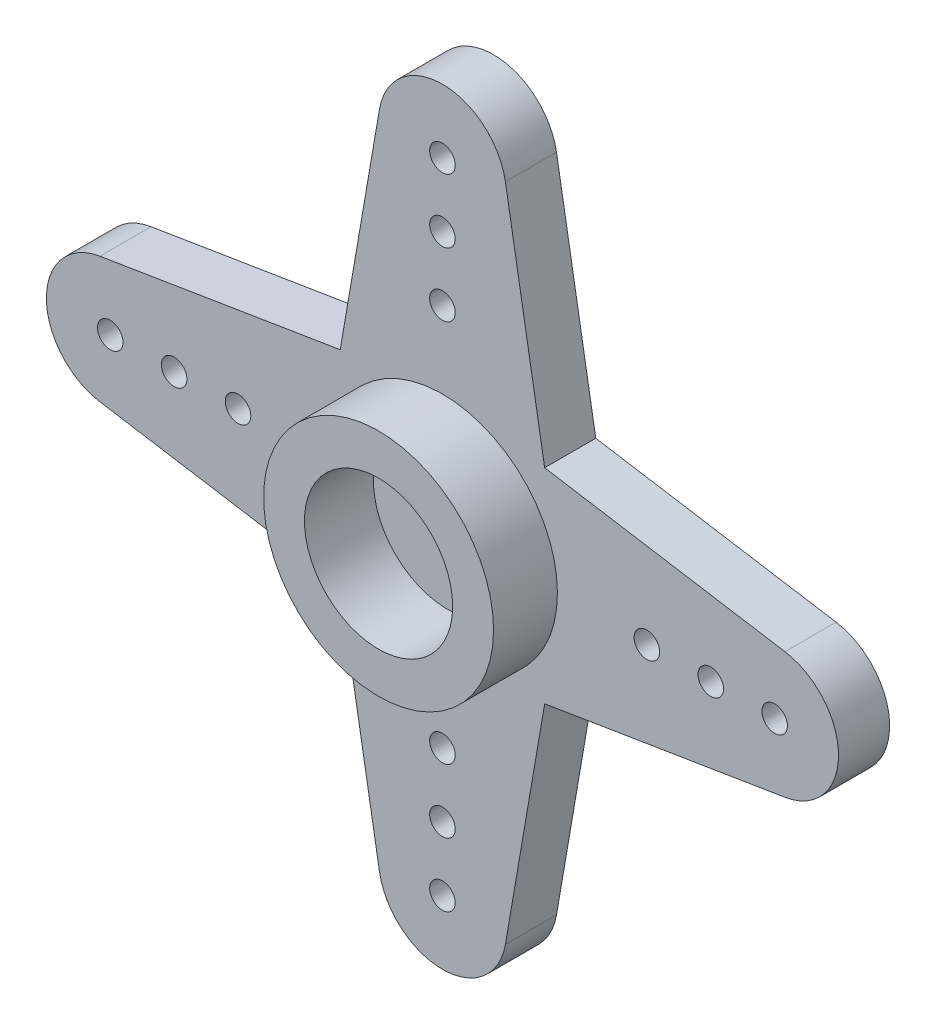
ISO-10303-21;
HEADER;
FILE_DESCRIPTION(('STEP AP214'),'2;1');
FILE_NAME('part.step','',(''),(''),'','','');
FILE_SCHEMA(('AUTOMOTIVE_DESIGN { 1 0 10303 214 1 1 1 1 }'));
ENDSEC;
DATA;
#1=APPLICATION_CONTEXT('core data for automotive mechanical design processes');
#2=APPLICATION_PROTOCOL_DEFINITION('international standard','automotive_design',2000,#1);
#3=PRODUCT_CONTEXT('',#1,'mechanical');
#4=PRODUCT('Part','Part','',(#3));
#5=PRODUCT_RELATED_PRODUCT_CATEGORY('part','',(#4));
#6=PRODUCT_DEFINITION_FORMATION('','',#4);
#7=PRODUCT_DEFINITION_CONTEXT('part definition',#1,'design');
#8=PRODUCT_DEFINITION('design','',#6,#7);
#9=PRODUCT_DEFINITION_SHAPE('','',#8);
#10=(LENGTH_UNIT() NAMED_UNIT(*) SI_UNIT(.MILLI.,.METRE.));
#11=(NAMED_UNIT(*) PLANE_ANGLE_UNIT() SI_UNIT($,.RADIAN.));
#12=(NAMED_UNIT(*) SI_UNIT($,.STERADIAN.) SOLID_ANGLE_UNIT());
#13=UNCERTAINTY_MEASURE_WITH_UNIT(LENGTH_MEASURE(1.E-05),#10,'distance_accuracy_value','');
#14=(GEOMETRIC_REPRESENTATION_CONTEXT(3) GLOBAL_UNCERTAINTY_ASSIGNED_CONTEXT((#13)) GLOBAL_UNIT_ASSIGNED_CONTEXT((#10,
#11,#12)) REPRESENTATION_CONTEXT('',''));
#15=CARTESIAN_POINT('',(0.,0.,0.));
#16=DIRECTION('',(0.,0.,1.));
#17=DIRECTION('',(1.,0.,0.));
#18=AXIS2_PLACEMENT_3D('',#15,#16,#17);
#19=CARTESIAN_POINT('',(0.,-12.5,2.));
#20=DIRECTION('',(0.,0.,1.));
#21=DIRECTION('',(1.,0.,0.));
#22=AXIS2_PLACEMENT_3D('',#19,#20,#21);
#23=PLANE('',#22);
#24=CARTESIAN_POINT('',(0.,-12.5,2.));
#25=DIRECTION('',(0.,0.,1.));
#26=DIRECTION('',(1.,0.,0.));
#27=AXIS2_PLACEMENT_3D('',#24,#25,#26);
#28=CIRCLE('',#27,0.5);
#29=CARTESIAN_POINT('',(0.5,-12.5,2.));
#30=VERTEX_POINT('',#29);
#31=EDGE_CURVE('E570',#30,#30,#28,.T.);
#32=ORIENTED_EDGE('',*,*,#31,.F.);
#33=EDGE_LOOP('',(#32));
#34=FACE_BOUND('',#33,.T.);
#35=CARTESIAN_POINT('',(0.,-7.5,2.));
#36=DIRECTION('',(0.,0.,1.));
#37=DIRECTION('',(1.,0.,0.));
#38=AXIS2_PLACEMENT_3D('',#35,#36,#37);
#39=CIRCLE('',#38,0.5);
#40=CARTESIAN_POINT('',(0.5,-7.5,2.));
#41=VERTEX_POINT('',#40);
#42=EDGE_CURVE('E582',#41,#41,#39,.T.);
#43=ORIENTED_EDGE('',*,*,#42,.F.);
#44=EDGE_LOOP('',(#43));
#45=FACE_BOUND('',#44,.T.);
#46=CARTESIAN_POINT('',(0.,10.,2.));
#47=DIRECTION('',(0.,0.,1.));
#48=DIRECTION('',(1.,0.,0.));
#49=AXIS2_PLACEMENT_3D('',#46,#47,#48);
#50=CIRCLE('',#49,0.5);
#51=CARTESIAN_POINT('',(0.5,10.,2.));
#52=VERTEX_POINT('',#51);
#53=EDGE_CURVE('E594',#52,#52,#50,.T.);
#54=ORIENTED_EDGE('',*,*,#53,.F.);
#55=EDGE_LOOP('',(#54));
#56=FACE_BOUND('',#55,.T.);
#57=CARTESIAN_POINT('',(10.5,0.,2.));
#58=DIRECTION('',(0.,0.,1.));
#59=DIRECTION('',(1.,0.,0.));
#60=AXIS2_PLACEMENT_3D('',#57,#58,#59);
#61=CIRCLE('',#60,0.500000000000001);
#62=CARTESIAN_POINT('',(11.,0.,2.));
#63=VERTEX_POINT('',#62);
#64=EDGE_CURVE('E606',#63,#63,#61,.T.);
#65=ORIENTED_EDGE('',*,*,#64,.F.);
#66=EDGE_LOOP('',(#65));
#67=FACE_BOUND('',#66,.T.);
#68=CARTESIAN_POINT('',(-8.,0.,2.));
#69=DIRECTION('',(0.,0.,1.));
#70=DIRECTION('',(1.,0.,0.));
#71=AXIS2_PLACEMENT_3D('',#68,#69,#70);
#72=CIRCLE('',#71,0.500000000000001);
#73=CARTESIAN_POINT('',(-7.5,0.,2.));
#74=VERTEX_POINT('',#73);
#75=EDGE_CURVE('E618',#74,#74,#72,.T.);
#76=ORIENTED_EDGE('',*,*,#75,.F.);
#77=EDGE_LOOP('',(#76));
#78=FACE_BOUND('',#77,.T.);
#79=CARTESIAN_POINT('',(-13.,0.,2.));
#80=DIRECTION('',(0.,0.,1.));
#81=DIRECTION('',(1.,0.,0.));
#82=AXIS2_PLACEMENT_3D('',#79,#80,#81);
#83=CIRCLE('',#82,0.500000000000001);
#84=CARTESIAN_POINT('',(-12.5,0.,2.));
#85=VERTEX_POINT('',#84);
#86=EDGE_CURVE('E630',#85,#85,#83,.T.);
#87=ORIENTED_EDGE('',*,*,#86,.F.);
#88=EDGE_LOOP('',(#87));
#89=FACE_BOUND('',#88,.T.);
#90=DIRECTION('',(0.169649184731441,0.985504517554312,0.));
#91=VECTOR('',#90,1.);
#92=CARTESIAN_POINT('',(4.,-4.,2.));
#93=LINE('',#92,#91);
#94=CARTESIAN_POINT('',(2.46376129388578,-12.9241229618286,2.));
#95=VERTEX_POINT('',#94);
#96=CARTESIAN_POINT('',(4.,-4.,2.));
#97=VERTEX_POINT('',#96);
#98=EDGE_CURVE('E179',#95,#97,#93,.T.);
#99=ORIENTED_EDGE('',*,*,#98,.T.);
#100=DIRECTION('',(0.986974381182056,0.160877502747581,0.));
#101=VECTOR('',#100,1.);
#102=CARTESIAN_POINT('',(13.402193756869,-2.46743595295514,2.));
#103=LINE('',#102,#101);
#104=CARTESIAN_POINT('',(13.402193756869,-2.46743595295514,2.));
#105=VERTEX_POINT('',#104);
#106=EDGE_CURVE('E107',#97,#105,#103,.T.);
#107=ORIENTED_EDGE('',*,*,#106,.T.);
#108=CARTESIAN_POINT('',(13.,0.,2.));
#109=DIRECTION('',(0.,0.,1.));
#110=DIRECTION('',(1.,0.,0.));
#111=AXIS2_PLACEMENT_3D('',#108,#109,#110);
#112=CIRCLE('',#111,2.5);
#113=CARTESIAN_POINT('',(13.402193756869,2.46743595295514,2.));
#114=VERTEX_POINT('',#113);
#115=EDGE_CURVE('E225',#105,#114,#112,.T.);
#116=ORIENTED_EDGE('',*,*,#115,.T.);
#117=DIRECTION('',(-0.986974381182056,0.16087750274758,0.));
#118=VECTOR('',#117,1.);
#119=CARTESIAN_POINT('',(4.,4.,2.));
#120=LINE('',#119,#118);
#121=CARTESIAN_POINT('',(4.,4.,2.));
#122=VERTEX_POINT('',#121);
#123=EDGE_CURVE('E222',#114,#122,#120,.T.);
#124=ORIENTED_EDGE('',*,*,#123,.T.);
#125=DIRECTION('',(-0.169649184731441,0.985504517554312,0.));
#126=VECTOR('',#125,1.);
#127=CARTESIAN_POINT('',(4.,4.,2.));
#128=LINE('',#127,#126);
#129=CARTESIAN_POINT('',(2.46376129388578,12.9241229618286,2.));
#130=VERTEX_POINT('',#129);
#131=EDGE_CURVE('E224',#122,#130,#128,.T.);
#132=ORIENTED_EDGE('',*,*,#131,.T.);
#133=CARTESIAN_POINT('',(0.,12.5,2.));
#134=DIRECTION('',(0.,0.,1.));
#135=DIRECTION('',(1.,0.,0.));
#136=AXIS2_PLACEMENT_3D('',#133,#134,#135);
#137=CIRCLE('',#136,2.5);
#138=CARTESIAN_POINT('',(-2.46376129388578,12.9241229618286,2.));
#139=VERTEX_POINT('',#138);
#140=EDGE_CURVE('E227',#130,#139,#137,.T.);
#141=ORIENTED_EDGE('',*,*,#140,.T.);
#142=DIRECTION('',(-0.169649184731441,-0.985504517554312,0.));
#143=VECTOR('',#142,1.);
#144=CARTESIAN_POINT('',(-4.,4.,2.));
#145=LINE('',#144,#143);
#146=CARTESIAN_POINT('',(-4.,4.,2.));
#147=VERTEX_POINT('',#146);
#148=EDGE_CURVE('E233',#139,#147,#145,.T.);
#149=ORIENTED_EDGE('',*,*,#148,.T.);
#150=DIRECTION('',(-0.986974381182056,-0.16087750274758,0.));
#151=VECTOR('',#150,1.);
#152=CARTESIAN_POINT('',(-13.402193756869,2.46743595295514,2.));
#153=LINE('',#152,#151);
#154=CARTESIAN_POINT('',(-13.402193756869,2.46743595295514,2.));
#155=VERTEX_POINT('',#154);
#156=EDGE_CURVE('E235',#147,#155,#153,.T.);
#157=ORIENTED_EDGE('',*,*,#156,.T.);
#158=CARTESIAN_POINT('',(-13.,0.,2.));
#159=DIRECTION('',(0.,0.,1.));
#160=DIRECTION('',(1.,0.,0.));
#161=AXIS2_PLACEMENT_3D('',#158,#159,#160);
#162=CIRCLE('',#161,2.5);
#163=CARTESIAN_POINT('',(-13.402193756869,-2.46743595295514,2.));
#164=VERTEX_POINT('',#163);
#165=EDGE_CURVE('E138',#155,#164,#162,.T.);
#166=ORIENTED_EDGE('',*,*,#165,.T.);
#167=DIRECTION('',(0.986974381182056,-0.16087750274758,0.));
#168=VECTOR('',#167,1.);
#169=CARTESIAN_POINT('',(-13.402193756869,-2.46743595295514,2.));
#170=LINE('',#169,#168);
#171=CARTESIAN_POINT('',(-4.,-4.,2.));
#172=VERTEX_POINT('',#171);
#173=EDGE_CURVE('E132',#164,#172,#170,.T.);
#174=ORIENTED_EDGE('',*,*,#173,.T.);
#175=DIRECTION('',(0.169649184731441,-0.985504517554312,0.));
#176=VECTOR('',#175,1.);
#177=CARTESIAN_POINT('',(-4.,-4.,2.));
#178=LINE('',#177,#176);
#179=CARTESIAN_POINT('',(-2.46376129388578,-12.9241229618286,2.));
#180=VERTEX_POINT('',#179);
#181=EDGE_CURVE('E136',#172,#180,#178,.T.);
#182=ORIENTED_EDGE('',*,*,#181,.T.);
#183=CARTESIAN_POINT('',(0.,-12.5,2.));
#184=DIRECTION('',(0.,0.,1.));
#185=DIRECTION('',(1.,0.,0.));
#186=AXIS2_PLACEMENT_3D('',#183,#184,#185);
#187=CIRCLE('',#186,2.5);
#188=EDGE_CURVE('E51',#180,#95,#187,.T.);
#189=ORIENTED_EDGE('',*,*,#188,.T.);
#190=EDGE_LOOP('',(#99,#107,#116,#124,#132,#141,#149,#157,#166,#174,#182,#189));
#191=FACE_BOUND('',#190,.T.);
#192=CARTESIAN_POINT('',(0.,12.5,2.));
#193=DIRECTION('',(0.,0.,1.));
#194=DIRECTION('',(1.,0.,0.));
#195=AXIS2_PLACEMENT_3D('',#192,#193,#194);
#196=CIRCLE('',#195,0.5);
#197=CARTESIAN_POINT('',(0.5,12.5,2.));
#198=VERTEX_POINT('',#197);
#199=EDGE_CURVE('E160',#198,#198,#196,.T.);
#200=ORIENTED_EDGE('',*,*,#199,.F.);
#201=EDGE_LOOP('',(#200));
#202=FACE_BOUND('',#201,.T.);
#203=CARTESIAN_POINT('',(-10.5,0.,2.));
#204=DIRECTION('',(0.,0.,1.));
#205=DIRECTION('',(1.,0.,0.));
#206=AXIS2_PLACEMENT_3D('',#203,#204,#205);
#207=CIRCLE('',#206,0.500000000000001);
#208=CARTESIAN_POINT('',(-10.,0.,2.));
#209=VERTEX_POINT('',#208);
#210=EDGE_CURVE('E624',#209,#209,#207,.T.);
#211=ORIENTED_EDGE('',*,*,#210,.F.);
#212=EDGE_LOOP('',(#211));
#213=FACE_BOUND('',#212,.T.);
#214=CARTESIAN_POINT('',(8.,0.,2.));
#215=DIRECTION('',(0.,0.,1.));
#216=DIRECTION('',(1.,0.,0.));
#217=AXIS2_PLACEMENT_3D('',#214,#215,#216);
#218=CIRCLE('',#217,0.500000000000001);
#219=CARTESIAN_POINT('',(8.5,0.,2.));
#220=VERTEX_POINT('',#219);
#221=EDGE_CURVE('E612',#220,#220,#218,.T.);
#222=ORIENTED_EDGE('',*,*,#221,.F.);
#223=EDGE_LOOP('',(#222));
#224=FACE_BOUND('',#223,.T.);
#225=CARTESIAN_POINT('',(13.,0.,2.));
#226=DIRECTION('',(0.,0.,1.));
#227=DIRECTION('',(1.,0.,0.));
#228=AXIS2_PLACEMENT_3D('',#225,#226,#227);
#229=CIRCLE('',#228,0.500000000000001);
#230=CARTESIAN_POINT('',(13.5,0.,2.));
#231=VERTEX_POINT('',#230);
#232=EDGE_CURVE('E600',#231,#231,#229,.T.);
#233=ORIENTED_EDGE('',*,*,#232,.F.);
#234=EDGE_LOOP('',(#233));
#235=FACE_BOUND('',#234,.T.);
#236=CARTESIAN_POINT('',(0.,7.5,2.));
#237=DIRECTION('',(0.,0.,1.));
#238=DIRECTION('',(1.,0.,0.));
#239=AXIS2_PLACEMENT_3D('',#236,#237,#238);
#240=CIRCLE('',#239,0.5);
#241=CARTESIAN_POINT('',(0.5,7.5,2.));
#242=VERTEX_POINT('',#241);
#243=EDGE_CURVE('E588',#242,#242,#240,.T.);
#244=ORIENTED_EDGE('',*,*,#243,.F.);
#245=EDGE_LOOP('',(#244));
#246=FACE_BOUND('',#245,.T.);
#247=CARTESIAN_POINT('',(0.,-10.,2.));
#248=DIRECTION('',(0.,0.,1.));
#249=DIRECTION('',(1.,0.,0.));
#250=AXIS2_PLACEMENT_3D('',#247,#248,#249);
#251=CIRCLE('',#250,0.5);
#252=CARTESIAN_POINT('',(0.5,-10.,2.));
#253=VERTEX_POINT('',#252);
#254=EDGE_CURVE('E576',#253,#253,#251,.T.);
#255=ORIENTED_EDGE('',*,*,#254,.F.);
#256=EDGE_LOOP('',(#255));
#257=FACE_BOUND('',#256,.T.);
#258=CARTESIAN_POINT('',(0.,0.,2.));
#259=DIRECTION('',(0.,0.,1.));
#260=DIRECTION('',(1.,0.,0.));
#261=AXIS2_PLACEMENT_3D('',#258,#259,#260);
#262=CIRCLE('',#261,4.5);
#263=CARTESIAN_POINT('',(4.5,0.,2.));
#264=VERTEX_POINT('',#263);
#265=EDGE_CURVE('E555',#264,#264,#262,.T.);
#266=ORIENTED_EDGE('',*,*,#265,.F.);
#267=EDGE_LOOP('',(#266));
#268=FACE_BOUND('',#267,.T.);
#269=ADVANCED_FACE('F34',(#34,#45,#56,#67,#78,#89,#191,#202,#213,#224,#235,#246,#257,#268),#23,.T.);
#270=CARTESIAN_POINT('',(0.,-12.5,0.));
#271=DIRECTION('',(0.,0.,1.));
#272=DIRECTION('',(1.,0.,0.));
#273=AXIS2_PLACEMENT_3D('',#270,#271,#272);
#274=PLANE('',#273);
#275=CARTESIAN_POINT('',(0.,-12.5,0.));
#276=DIRECTION('',(0.,0.,1.));
#277=DIRECTION('',(1.,0.,0.));
#278=AXIS2_PLACEMENT_3D('',#275,#276,#277);
#279=CIRCLE('',#278,0.5);
#280=CARTESIAN_POINT('',(0.5,-12.5,0.));
#281=VERTEX_POINT('',#280);
#282=EDGE_CURVE('E569',#281,#281,#279,.T.);
#283=ORIENTED_EDGE('',*,*,#282,.T.);
#284=EDGE_LOOP('',(#283));
#285=FACE_BOUND('',#284,.T.);
#286=CARTESIAN_POINT('',(0.,-7.5,0.));
#287=DIRECTION('',(0.,0.,1.));
#288=DIRECTION('',(1.,0.,0.));
#289=AXIS2_PLACEMENT_3D('',#286,#287,#288);
#290=CIRCLE('',#289,0.5);
#291=CARTESIAN_POINT('',(0.5,-7.5,0.));
#292=VERTEX_POINT('',#291);
#293=EDGE_CURVE('E579',#292,#292,#290,.T.);
#294=ORIENTED_EDGE('',*,*,#293,.T.);
#295=EDGE_LOOP('',(#294));
#296=FACE_BOUND('',#295,.T.);
#297=CARTESIAN_POINT('',(0.,10.,0.));
#298=DIRECTION('',(0.,0.,1.));
#299=DIRECTION('',(1.,0.,0.));
#300=AXIS2_PLACEMENT_3D('',#297,#298,#299);
#301=CIRCLE('',#300,0.5);
#302=CARTESIAN_POINT('',(0.5,10.,0.));
#303=VERTEX_POINT('',#302);
#304=EDGE_CURVE('E591',#303,#303,#301,.T.);
#305=ORIENTED_EDGE('',*,*,#304,.T.);
#306=EDGE_LOOP('',(#305));
#307=FACE_BOUND('',#306,.T.);
#308=CARTESIAN_POINT('',(10.5,0.,0.));
#309=DIRECTION('',(0.,0.,1.));
#310=DIRECTION('',(1.,0.,0.));
#311=AXIS2_PLACEMENT_3D('',#308,#309,#310);
#312=CIRCLE('',#311,0.500000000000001);
#313=CARTESIAN_POINT('',(11.,0.,0.));
#314=VERTEX_POINT('',#313);
#315=EDGE_CURVE('E603',#314,#314,#312,.T.);
#316=ORIENTED_EDGE('',*,*,#315,.T.);
#317=EDGE_LOOP('',(#316));
#318=FACE_BOUND('',#317,.T.);
#319=CARTESIAN_POINT('',(-8.,0.,0.));
#320=DIRECTION('',(0.,0.,1.));
#321=DIRECTION('',(1.,0.,0.));
#322=AXIS2_PLACEMENT_3D('',#319,#320,#321);
#323=CIRCLE('',#322,0.500000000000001);
#324=CARTESIAN_POINT('',(-7.5,0.,0.));
#325=VERTEX_POINT('',#324);
#326=EDGE_CURVE('E615',#325,#325,#323,.T.);
#327=ORIENTED_EDGE('',*,*,#326,.T.);
#328=EDGE_LOOP('',(#327));
#329=FACE_BOUND('',#328,.T.);
#330=CARTESIAN_POINT('',(-13.,0.,0.));
#331=DIRECTION('',(0.,0.,1.));
#332=DIRECTION('',(1.,0.,0.));
#333=AXIS2_PLACEMENT_3D('',#330,#331,#332);
#334=CIRCLE('',#333,0.500000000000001);
#335=CARTESIAN_POINT('',(-12.5,0.,0.));
#336=VERTEX_POINT('',#335);
#337=EDGE_CURVE('E627',#336,#336,#334,.T.);
#338=ORIENTED_EDGE('',*,*,#337,.T.);
#339=EDGE_LOOP('',(#338));
#340=FACE_BOUND('',#339,.T.);
#341=DIRECTION('',(0.169649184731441,0.985504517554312,0.));
#342=VECTOR('',#341,1.);
#343=CARTESIAN_POINT('',(4.,-4.,0.));
#344=LINE('',#343,#342);
#345=CARTESIAN_POINT('',(2.46376129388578,-12.9241229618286,0.));
#346=VERTEX_POINT('',#345);
#347=CARTESIAN_POINT('',(4.,-4.,0.));
#348=VERTEX_POINT('',#347);
#349=EDGE_CURVE('E156',#346,#348,#344,.T.);
#350=ORIENTED_EDGE('',*,*,#349,.F.);
#351=CARTESIAN_POINT('',(0.,-12.5,0.));
#352=DIRECTION('',(0.,0.,1.));
#353=DIRECTION('',(1.,0.,0.));
#354=AXIS2_PLACEMENT_3D('',#351,#352,#353);
#355=CIRCLE('',#354,2.5);
#356=CARTESIAN_POINT('',(-2.46376129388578,-12.9241229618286,0.));
#357=VERTEX_POINT('',#356);
#358=EDGE_CURVE('E98',#357,#346,#355,.T.);
#359=ORIENTED_EDGE('',*,*,#358,.F.);
#360=DIRECTION('',(0.169649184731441,-0.985504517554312,0.));
#361=VECTOR('',#360,1.);
#362=CARTESIAN_POINT('',(-4.,-4.,0.));
#363=LINE('',#362,#361);
#364=CARTESIAN_POINT('',(-4.,-4.,0.));
#365=VERTEX_POINT('',#364);
#366=EDGE_CURVE('E92',#365,#357,#363,.T.);
#367=ORIENTED_EDGE('',*,*,#366,.F.);
#368=DIRECTION('',(0.986974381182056,-0.16087750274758,0.));
#369=VECTOR('',#368,1.);
#370=CARTESIAN_POINT('',(-13.402193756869,-2.46743595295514,0.));
#371=LINE('',#370,#369);
#372=CARTESIAN_POINT('',(-13.402193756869,-2.46743595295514,0.));
#373=VERTEX_POINT('',#372);
#374=EDGE_CURVE('E146',#373,#365,#371,.T.);
#375=ORIENTED_EDGE('',*,*,#374,.F.);
#376=CARTESIAN_POINT('',(-13.,0.,0.));
#377=DIRECTION('',(0.,0.,1.));
#378=DIRECTION('',(1.,0.,0.));
#379=AXIS2_PLACEMENT_3D('',#376,#377,#378);
#380=CIRCLE('',#379,2.5);
#381=CARTESIAN_POINT('',(-13.402193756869,2.46743595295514,0.));
#382=VERTEX_POINT('',#381);
#383=EDGE_CURVE('E174',#382,#373,#380,.T.);
#384=ORIENTED_EDGE('',*,*,#383,.F.);
#385=DIRECTION('',(-0.986974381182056,-0.16087750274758,0.));
#386=VECTOR('',#385,1.);
#387=CARTESIAN_POINT('',(-13.402193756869,2.46743595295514,0.));
#388=LINE('',#387,#386);
#389=CARTESIAN_POINT('',(-4.,4.,0.));
#390=VERTEX_POINT('',#389);
#391=EDGE_CURVE('E172',#390,#382,#388,.T.);
#392=ORIENTED_EDGE('',*,*,#391,.F.);
#393=DIRECTION('',(-0.169649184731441,-0.985504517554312,0.));
#394=VECTOR('',#393,1.);
#395=CARTESIAN_POINT('',(-4.,4.,0.));
#396=LINE('',#395,#394);
#397=CARTESIAN_POINT('',(-2.46376129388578,12.9241229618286,0.));
#398=VERTEX_POINT('',#397);
#399=EDGE_CURVE('E170',#398,#390,#396,.T.);
#400=ORIENTED_EDGE('',*,*,#399,.F.);
#401=CARTESIAN_POINT('',(0.,12.5,0.));
#402=DIRECTION('',(0.,0.,1.));
#403=DIRECTION('',(1.,0.,0.));
#404=AXIS2_PLACEMENT_3D('',#401,#402,#403);
#405=CIRCLE('',#404,2.5);
#406=CARTESIAN_POINT('',(2.46376129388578,12.9241229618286,0.));
#407=VERTEX_POINT('',#406);
#408=EDGE_CURVE('E168',#407,#398,#405,.T.);
#409=ORIENTED_EDGE('',*,*,#408,.F.);
#410=DIRECTION('',(-0.169649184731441,0.985504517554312,0.));
#411=VECTOR('',#410,1.);
#412=CARTESIAN_POINT('',(4.,4.,0.));
#413=LINE('',#412,#411);
#414=CARTESIAN_POINT('',(4.,4.,0.));
#415=VERTEX_POINT('',#414);
#416=EDGE_CURVE('E166',#415,#407,#413,.T.);
#417=ORIENTED_EDGE('',*,*,#416,.F.);
#418=DIRECTION('',(-0.986974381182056,0.16087750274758,0.));
#419=VECTOR('',#418,1.);
#420=CARTESIAN_POINT('',(4.,4.,0.));
#421=LINE('',#420,#419);
#422=CARTESIAN_POINT('',(13.402193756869,2.46743595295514,0.));
#423=VERTEX_POINT('',#422);
#424=EDGE_CURVE('E164',#423,#415,#421,.T.);
#425=ORIENTED_EDGE('',*,*,#424,.F.);
#426=CARTESIAN_POINT('',(13.,0.,0.));
#427=DIRECTION('',(0.,0.,1.));
#428=DIRECTION('',(1.,0.,0.));
#429=AXIS2_PLACEMENT_3D('',#426,#427,#428);
#430=CIRCLE('',#429,2.5);
#431=CARTESIAN_POINT('',(13.402193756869,-2.46743595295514,0.));
#432=VERTEX_POINT('',#431);
#433=EDGE_CURVE('E162',#432,#423,#430,.T.);
#434=ORIENTED_EDGE('',*,*,#433,.F.);
#435=DIRECTION('',(0.986974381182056,0.160877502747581,0.));
#436=VECTOR('',#435,1.);
#437=CARTESIAN_POINT('',(13.402193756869,-2.46743595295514,0.));
#438=LINE('',#437,#436);
#439=EDGE_CURVE('E159',#348,#432,#438,.T.);
#440=ORIENTED_EDGE('',*,*,#439,.F.);
#441=EDGE_LOOP('',(#350,#359,#367,#375,#384,#392,#400,#409,#417,#425,#434,#440));
#442=FACE_BOUND('',#441,.T.);
#443=CARTESIAN_POINT('',(0.,12.5,0.));
#444=DIRECTION('',(0.,0.,1.));
#445=DIRECTION('',(1.,0.,0.));
#446=AXIS2_PLACEMENT_3D('',#443,#444,#445);
#447=CIRCLE('',#446,0.5);
#448=CARTESIAN_POINT('',(0.5,12.5,0.));
#449=VERTEX_POINT('',#448);
#450=EDGE_CURVE('E633',#449,#449,#447,.T.);
#451=ORIENTED_EDGE('',*,*,#450,.T.);
#452=EDGE_LOOP('',(#451));
#453=FACE_BOUND('',#452,.T.);
#454=CARTESIAN_POINT('',(-10.5,0.,0.));
#455=DIRECTION('',(0.,0.,1.));
#456=DIRECTION('',(1.,0.,0.));
#457=AXIS2_PLACEMENT_3D('',#454,#455,#456);
#458=CIRCLE('',#457,0.500000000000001);
#459=CARTESIAN_POINT('',(-10.,0.,0.));
#460=VERTEX_POINT('',#459);
#461=EDGE_CURVE('E621',#460,#460,#458,.T.);
#462=ORIENTED_EDGE('',*,*,#461,.T.);
#463=EDGE_LOOP('',(#462));
#464=FACE_BOUND('',#463,.T.);
#465=CARTESIAN_POINT('',(8.,0.,0.));
#466=DIRECTION('',(0.,0.,1.));
#467=DIRECTION('',(1.,0.,0.));
#468=AXIS2_PLACEMENT_3D('',#465,#466,#467);
#469=CIRCLE('',#468,0.500000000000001);
#470=CARTESIAN_POINT('',(8.5,0.,0.));
#471=VERTEX_POINT('',#470);
#472=EDGE_CURVE('E609',#471,#471,#469,.T.);
#473=ORIENTED_EDGE('',*,*,#472,.T.);
#474=EDGE_LOOP('',(#473));
#475=FACE_BOUND('',#474,.T.);
#476=CARTESIAN_POINT('',(13.,0.,0.));
#477=DIRECTION('',(0.,0.,1.));
#478=DIRECTION('',(1.,0.,0.));
#479=AXIS2_PLACEMENT_3D('',#476,#477,#478);
#480=CIRCLE('',#479,0.500000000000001);
#481=CARTESIAN_POINT('',(13.5,0.,0.));
#482=VERTEX_POINT('',#481);
#483=EDGE_CURVE('E597',#482,#482,#480,.T.);
#484=ORIENTED_EDGE('',*,*,#483,.T.);
#485=EDGE_LOOP('',(#484));
#486=FACE_BOUND('',#485,.T.);
#487=CARTESIAN_POINT('',(0.,7.5,0.));
#488=DIRECTION('',(0.,0.,1.));
#489=DIRECTION('',(1.,0.,0.));
#490=AXIS2_PLACEMENT_3D('',#487,#488,#489);
#491=CIRCLE('',#490,0.5);
#492=CARTESIAN_POINT('',(0.5,7.5,0.));
#493=VERTEX_POINT('',#492);
#494=EDGE_CURVE('E585',#493,#493,#491,.T.);
#495=ORIENTED_EDGE('',*,*,#494,.T.);
#496=EDGE_LOOP('',(#495));
#497=FACE_BOUND('',#496,.T.);
#498=CARTESIAN_POINT('',(0.,-10.,0.));
#499=DIRECTION('',(0.,0.,1.));
#500=DIRECTION('',(1.,0.,0.));
#501=AXIS2_PLACEMENT_3D('',#498,#499,#500);
#502=CIRCLE('',#501,0.5);
#503=CARTESIAN_POINT('',(0.5,-10.,0.));
#504=VERTEX_POINT('',#503);
#505=EDGE_CURVE('E573',#504,#504,#502,.T.);
#506=ORIENTED_EDGE('',*,*,#505,.T.);
#507=EDGE_LOOP('',(#506));
#508=FACE_BOUND('',#507,.T.);
#509=CARTESIAN_POINT('',(0.,0.,0.));
#510=DIRECTION('',(0.,0.,1.));
#511=DIRECTION('',(1.,0.,0.));
#512=AXIS2_PLACEMENT_3D('',#509,#510,#511);
#513=CIRCLE('',#512,3.75);
#514=CARTESIAN_POINT('',(3.75,0.,0.));
#515=VERTEX_POINT('',#514);
#516=EDGE_CURVE('E11',#515,#515,#513,.F.);
#517=ORIENTED_EDGE('',*,*,#516,.F.);
#518=EDGE_LOOP('',(#517));
#519=FACE_BOUND('',#518,.T.);
#520=ADVANCED_FACE('F209',(#285,#296,#307,#318,#329,#340,#442,#453,#464,#475,#486,#497,#508,
#519),#274,.F.);
#521=CARTESIAN_POINT('',(4.,-4.,2.));
#522=DIRECTION('',(-0.985504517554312,0.169649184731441,0.));
#523=DIRECTION('',(-0.169649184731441,-0.985504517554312,0.));
#524=AXIS2_PLACEMENT_3D('',#521,#522,#523);
#525=PLANE('',#524);
#526=ORIENTED_EDGE('',*,*,#349,.T.);
#527=DIRECTION('',(0.,0.,-1.));
#528=VECTOR('',#527,1.);
#529=CARTESIAN_POINT('',(4.,-4.,2.));
#530=LINE('',#529,#528);
#531=EDGE_CURVE('E43',#97,#348,#530,.T.);
#532=ORIENTED_EDGE('',*,*,#531,.F.);
#533=ORIENTED_EDGE('',*,*,#98,.F.);
#534=DIRECTION('',(0.,0.,-1.));
#535=VECTOR('',#534,1.);
#536=CARTESIAN_POINT('',(2.46376129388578,-12.9241229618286,2.));
#537=LINE('',#536,#535);
#538=EDGE_CURVE('E152',#95,#346,#537,.T.);
#539=ORIENTED_EDGE('',*,*,#538,.T.);
#540=EDGE_LOOP('',(#526,#532,#533,#539));
#541=FACE_BOUND('',#540,.T.);
#542=ADVANCED_FACE('F36',(#541),#525,.F.);
#543=CARTESIAN_POINT('',(13.402193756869,-2.46743595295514,2.));
#544=DIRECTION('',(-0.160877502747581,0.986974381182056,0.));
#545=DIRECTION('',(-0.986974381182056,-0.160877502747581,0.));
#546=AXIS2_PLACEMENT_3D('',#543,#544,#545);
#547=PLANE('',#546);
#548=ORIENTED_EDGE('',*,*,#439,.T.);
#549=DIRECTION('',(0.,0.,-1.));
#550=VECTOR('',#549,1.);
#551=CARTESIAN_POINT('',(13.402193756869,-2.46743595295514,2.));
#552=LINE('',#551,#550);
#553=EDGE_CURVE('E201',#105,#432,#552,.T.);
#554=ORIENTED_EDGE('',*,*,#553,.F.);
#555=ORIENTED_EDGE('',*,*,#106,.F.);
#556=ORIENTED_EDGE('',*,*,#531,.T.);
#557=EDGE_LOOP('',(#548,#554,#555,#556));
#558=FACE_BOUND('',#557,.T.);
#559=ADVANCED_FACE('F204',(#558),#547,.F.);
#560=CARTESIAN_POINT('',(13.,0.,2.));
#561=DIRECTION('',(0.,0.,-1.));
#562=DIRECTION('',(-1.,0.,0.));
#563=AXIS2_PLACEMENT_3D('',#560,#561,#562);
#564=CYLINDRICAL_SURFACE('',#563,2.5);
#565=ORIENTED_EDGE('',*,*,#433,.T.);
#566=DIRECTION('',(0.,0.,-1.));
#567=VECTOR('',#566,1.);
#568=CARTESIAN_POINT('',(13.402193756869,2.46743595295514,2.));
#569=LINE('',#568,#567);
#570=EDGE_CURVE('E198',#114,#423,#569,.T.);
#571=ORIENTED_EDGE('',*,*,#570,.F.);
#572=ORIENTED_EDGE('',*,*,#115,.F.);
#573=ORIENTED_EDGE('',*,*,#553,.T.);
#574=EDGE_LOOP('',(#565,#571,#572,#573));
#575=FACE_BOUND('',#574,.T.);
#576=ADVANCED_FACE('F216',(#575),#564,.T.);
#577=CARTESIAN_POINT('',(4.,4.,2.));
#578=DIRECTION('',(-0.16087750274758,-0.986974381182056,0.));
#579=DIRECTION('',(0.986974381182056,-0.16087750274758,0.));
#580=AXIS2_PLACEMENT_3D('',#577,#578,#579);
#581=PLANE('',#580);
#582=ORIENTED_EDGE('',*,*,#424,.T.);
#583=DIRECTION('',(0.,0.,-1.));
#584=VECTOR('',#583,1.);
#585=CARTESIAN_POINT('',(4.,4.,2.));
#586=LINE('',#585,#584);
#587=EDGE_CURVE('E195',#122,#415,#586,.T.);
#588=ORIENTED_EDGE('',*,*,#587,.F.);
#589=ORIENTED_EDGE('',*,*,#123,.F.);
#590=ORIENTED_EDGE('',*,*,#570,.T.);
#591=EDGE_LOOP('',(#582,#588,#589,#590));
#592=FACE_BOUND('',#591,.T.);
#593=ADVANCED_FACE('F220',(#592),#581,.F.);
#594=CARTESIAN_POINT('',(4.,4.,2.));
#595=DIRECTION('',(-0.985504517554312,-0.169649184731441,0.));
#596=DIRECTION('',(0.169649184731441,-0.985504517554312,0.));
#597=AXIS2_PLACEMENT_3D('',#594,#595,#596);
#598=PLANE('',#597);
#599=ORIENTED_EDGE('',*,*,#416,.T.);
#600=DIRECTION('',(0.,0.,-1.));
#601=VECTOR('',#600,1.);
#602=CARTESIAN_POINT('',(2.46376129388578,12.9241229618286,2.));
#603=LINE('',#602,#601);
#604=EDGE_CURVE('E192',#130,#407,#603,.T.);
#605=ORIENTED_EDGE('',*,*,#604,.F.);
#606=ORIENTED_EDGE('',*,*,#131,.F.);
#607=ORIENTED_EDGE('',*,*,#587,.T.);
#608=EDGE_LOOP('',(#599,#605,#606,#607));
#609=FACE_BOUND('',#608,.T.);
#610=ADVANCED_FACE('F256',(#609),#598,.F.);
#611=CARTESIAN_POINT('',(0.,12.5,2.));
#612=DIRECTION('',(0.,0.,-1.));
#613=DIRECTION('',(-1.,0.,0.));
#614=AXIS2_PLACEMENT_3D('',#611,#612,#613);
#615=CYLINDRICAL_SURFACE('',#614,2.5);
#616=ORIENTED_EDGE('',*,*,#408,.T.);
#617=DIRECTION('',(0.,0.,-1.));
#618=VECTOR('',#617,1.);
#619=CARTESIAN_POINT('',(-2.46376129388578,12.9241229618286,2.));
#620=LINE('',#619,#618);
#621=EDGE_CURVE('E189',#139,#398,#620,.T.);
#622=ORIENTED_EDGE('',*,*,#621,.F.);
#623=ORIENTED_EDGE('',*,*,#140,.F.);
#624=ORIENTED_EDGE('',*,*,#604,.T.);
#625=EDGE_LOOP('',(#616,#622,#623,#624));
#626=FACE_BOUND('',#625,.T.);
#627=ADVANCED_FACE('F253',(#626),#615,.T.);
#628=CARTESIAN_POINT('',(-4.,4.,2.));
#629=DIRECTION('',(0.985504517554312,-0.169649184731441,0.));
#630=DIRECTION('',(0.169649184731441,0.985504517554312,0.));
#631=AXIS2_PLACEMENT_3D('',#628,#629,#630);
#632=PLANE('',#631);
#633=ORIENTED_EDGE('',*,*,#399,.T.);
#634=DIRECTION('',(0.,0.,-1.));
#635=VECTOR('',#634,1.);
#636=CARTESIAN_POINT('',(-4.,4.,2.));
#637=LINE('',#636,#635);
#638=EDGE_CURVE('E186',#147,#390,#637,.T.);
#639=ORIENTED_EDGE('',*,*,#638,.F.);
#640=ORIENTED_EDGE('',*,*,#148,.F.);
#641=ORIENTED_EDGE('',*,*,#621,.T.);
#642=EDGE_LOOP('',(#633,#639,#640,#641));
#643=FACE_BOUND('',#642,.T.);
#644=ADVANCED_FACE('F249',(#643),#632,.F.);
#645=CARTESIAN_POINT('',(-13.402193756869,2.46743595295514,2.));
#646=DIRECTION('',(0.16087750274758,-0.986974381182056,0.));
#647=DIRECTION('',(0.986974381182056,0.16087750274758,0.));
#648=AXIS2_PLACEMENT_3D('',#645,#646,#647);
#649=PLANE('',#648);
#650=ORIENTED_EDGE('',*,*,#391,.T.);
#651=DIRECTION('',(0.,0.,-1.));
#652=VECTOR('',#651,1.);
#653=CARTESIAN_POINT('',(-13.402193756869,2.46743595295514,2.));
#654=LINE('',#653,#652);
#655=EDGE_CURVE('E183',#155,#382,#654,.T.);
#656=ORIENTED_EDGE('',*,*,#655,.F.);
#657=ORIENTED_EDGE('',*,*,#156,.F.);
#658=ORIENTED_EDGE('',*,*,#638,.T.);
#659=EDGE_LOOP('',(#650,#656,#657,#658));
#660=FACE_BOUND('',#659,.T.);
#661=ADVANCED_FACE('F241',(#660),#649,.F.);
#662=CARTESIAN_POINT('',(-13.,0.,2.));
#663=DIRECTION('',(0.,0.,-1.));
#664=DIRECTION('',(-1.,0.,0.));
#665=AXIS2_PLACEMENT_3D('',#662,#663,#664);
#666=CYLINDRICAL_SURFACE('',#665,2.5);
#667=ORIENTED_EDGE('',*,*,#383,.T.);
#668=DIRECTION('',(0.,0.,-1.));
#669=VECTOR('',#668,1.);
#670=CARTESIAN_POINT('',(-13.402193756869,-2.46743595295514,2.));
#671=LINE('',#670,#669);
#672=EDGE_CURVE('E147',#164,#373,#671,.T.);
#673=ORIENTED_EDGE('',*,*,#672,.F.);
#674=ORIENTED_EDGE('',*,*,#165,.F.);
#675=ORIENTED_EDGE('',*,*,#655,.T.);
#676=EDGE_LOOP('',(#667,#673,#674,#675));
#677=FACE_BOUND('',#676,.T.);
#678=ADVANCED_FACE('F245',(#677),#666,.T.);
#679=CARTESIAN_POINT('',(-13.402193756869,-2.46743595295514,2.));
#680=DIRECTION('',(0.16087750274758,0.986974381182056,0.));
#681=DIRECTION('',(-0.986974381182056,0.16087750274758,0.));
#682=AXIS2_PLACEMENT_3D('',#679,#680,#681);
#683=PLANE('',#682);
#684=ORIENTED_EDGE('',*,*,#374,.T.);
#685=DIRECTION('',(0.,0.,-1.));
#686=VECTOR('',#685,1.);
#687=CARTESIAN_POINT('',(-4.,-4.,2.));
#688=LINE('',#687,#686);
#689=EDGE_CURVE('E143',#172,#365,#688,.T.);
#690=ORIENTED_EDGE('',*,*,#689,.F.);
#691=ORIENTED_EDGE('',*,*,#173,.F.);
#692=ORIENTED_EDGE('',*,*,#672,.T.);
#693=EDGE_LOOP('',(#684,#690,#691,#692));
#694=FACE_BOUND('',#693,.T.);
#695=ADVANCED_FACE('F144',(#694),#683,.F.);
#696=CARTESIAN_POINT('',(-4.,-4.,2.));
#697=DIRECTION('',(0.985504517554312,0.169649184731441,0.));
#698=DIRECTION('',(-0.169649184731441,0.985504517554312,0.));
#699=AXIS2_PLACEMENT_3D('',#696,#697,#698);
#700=PLANE('',#699);
#701=ORIENTED_EDGE('',*,*,#366,.T.);
#702=DIRECTION('',(0.,0.,-1.));
#703=VECTOR('',#702,1.);
#704=CARTESIAN_POINT('',(-2.46376129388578,-12.9241229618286,2.));
#705=LINE('',#704,#703);
#706=EDGE_CURVE('E148',#180,#357,#705,.T.);
#707=ORIENTED_EDGE('',*,*,#706,.F.);
#708=ORIENTED_EDGE('',*,*,#181,.F.);
#709=ORIENTED_EDGE('',*,*,#689,.T.);
#710=EDGE_LOOP('',(#701,#707,#708,#709));
#711=FACE_BOUND('',#710,.T.);
#712=ADVANCED_FACE('F150',(#711),#700,.F.);
#713=CARTESIAN_POINT('',(0.,-12.5,2.));
#714=DIRECTION('',(0.,0.,-1.));
#715=DIRECTION('',(-1.,0.,0.));
#716=AXIS2_PLACEMENT_3D('',#713,#714,#715);
#717=CYLINDRICAL_SURFACE('',#716,2.5);
#718=ORIENTED_EDGE('',*,*,#358,.T.);
#719=ORIENTED_EDGE('',*,*,#538,.F.);
#720=ORIENTED_EDGE('',*,*,#188,.F.);
#721=ORIENTED_EDGE('',*,*,#706,.T.);
#722=EDGE_LOOP('',(#718,#719,#720,#721));
#723=FACE_BOUND('',#722,.T.);
#724=ADVANCED_FACE('F279',(#723),#717,.T.);
#725=CARTESIAN_POINT('',(0.,12.5,2.));
#726=DIRECTION('',(0.,0.,-1.));
#727=DIRECTION('',(-1.,0.,0.));
#728=AXIS2_PLACEMENT_3D('',#725,#726,#727);
#729=CYLINDRICAL_SURFACE('',#728,0.5);
#730=ORIENTED_EDGE('',*,*,#199,.T.);
#731=EDGE_LOOP('',(#730));
#732=FACE_BOUND('',#731,.T.);
#733=ORIENTED_EDGE('',*,*,#450,.F.);
#734=EDGE_LOOP('',(#733));
#735=FACE_BOUND('',#734,.T.);
#736=ADVANCED_FACE('F276',(#732,#735),#729,.F.);
#737=CARTESIAN_POINT('',(-13.,0.,2.));
#738=DIRECTION('',(0.,0.,-1.));
#739=DIRECTION('',(-1.,0.,0.));
#740=AXIS2_PLACEMENT_3D('',#737,#738,#739);
#741=CYLINDRICAL_SURFACE('',#740,0.500000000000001);
#742=ORIENTED_EDGE('',*,*,#86,.T.);
#743=EDGE_LOOP('',(#742));
#744=FACE_BOUND('',#743,.T.);
#745=ORIENTED_EDGE('',*,*,#337,.F.);
#746=EDGE_LOOP('',(#745));
#747=FACE_BOUND('',#746,.T.);
#748=ADVANCED_FACE('F321',(#744,#747),#741,.F.);
#749=CARTESIAN_POINT('',(-10.5,0.,2.));
#750=DIRECTION('',(0.,0.,-1.));
#751=DIRECTION('',(-1.,0.,0.));
#752=AXIS2_PLACEMENT_3D('',#749,#750,#751);
#753=CYLINDRICAL_SURFACE('',#752,0.500000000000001);
#754=ORIENTED_EDGE('',*,*,#210,.T.);
#755=EDGE_LOOP('',(#754));
#756=FACE_BOUND('',#755,.T.);
#757=ORIENTED_EDGE('',*,*,#461,.F.);
#758=EDGE_LOOP('',(#757));
#759=FACE_BOUND('',#758,.T.);
#760=ADVANCED_FACE('F328',(#756,#759),#753,.F.);
#761=CARTESIAN_POINT('',(-8.,0.,2.));
#762=DIRECTION('',(0.,0.,-1.));
#763=DIRECTION('',(-1.,0.,0.));
#764=AXIS2_PLACEMENT_3D('',#761,#762,#763);
#765=CYLINDRICAL_SURFACE('',#764,0.500000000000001);
#766=ORIENTED_EDGE('',*,*,#75,.T.);
#767=EDGE_LOOP('',(#766));
#768=FACE_BOUND('',#767,.T.);
#769=ORIENTED_EDGE('',*,*,#326,.F.);
#770=EDGE_LOOP('',(#769));
#771=FACE_BOUND('',#770,.T.);
#772=ADVANCED_FACE('F335',(#768,#771),#765,.F.);
#773=CARTESIAN_POINT('',(8.,0.,2.));
#774=DIRECTION('',(0.,0.,-1.));
#775=DIRECTION('',(-1.,0.,0.));
#776=AXIS2_PLACEMENT_3D('',#773,#774,#775);
#777=CYLINDRICAL_SURFACE('',#776,0.500000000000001);
#778=ORIENTED_EDGE('',*,*,#221,.T.);
#779=EDGE_LOOP('',(#778));
#780=FACE_BOUND('',#779,.T.);
#781=ORIENTED_EDGE('',*,*,#472,.F.);
#782=EDGE_LOOP('',(#781));
#783=FACE_BOUND('',#782,.T.);
#784=ADVANCED_FACE('F343',(#780,#783),#777,.F.);
#785=CARTESIAN_POINT('',(10.5,0.,2.));
#786=DIRECTION('',(0.,0.,-1.));
#787=DIRECTION('',(-1.,0.,0.));
#788=AXIS2_PLACEMENT_3D('',#785,#786,#787);
#789=CYLINDRICAL_SURFACE('',#788,0.500000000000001);
#790=ORIENTED_EDGE('',*,*,#64,.T.);
#791=EDGE_LOOP('',(#790));
#792=FACE_BOUND('',#791,.T.);
#793=ORIENTED_EDGE('',*,*,#315,.F.);
#794=EDGE_LOOP('',(#793));
#795=FACE_BOUND('',#794,.T.);
#796=ADVANCED_FACE('F351',(#792,#795),#789,.F.);
#797=CARTESIAN_POINT('',(13.,0.,2.));
#798=DIRECTION('',(0.,0.,-1.));
#799=DIRECTION('',(-1.,0.,0.));
#800=AXIS2_PLACEMENT_3D('',#797,#798,#799);
#801=CYLINDRICAL_SURFACE('',#800,0.500000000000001);
#802=ORIENTED_EDGE('',*,*,#232,.T.);
#803=EDGE_LOOP('',(#802));
#804=FACE_BOUND('',#803,.T.);
#805=ORIENTED_EDGE('',*,*,#483,.F.);
#806=EDGE_LOOP('',(#805));
#807=FACE_BOUND('',#806,.T.);
#808=ADVANCED_FACE('F359',(#804,#807),#801,.F.);
#809=CARTESIAN_POINT('',(0.,10.,2.));
#810=DIRECTION('',(0.,0.,-1.));
#811=DIRECTION('',(-1.,0.,0.));
#812=AXIS2_PLACEMENT_3D('',#809,#810,#811);
#813=CYLINDRICAL_SURFACE('',#812,0.5);
#814=ORIENTED_EDGE('',*,*,#53,.T.);
#815=EDGE_LOOP('',(#814));
#816=FACE_BOUND('',#815,.T.);
#817=ORIENTED_EDGE('',*,*,#304,.F.);
#818=EDGE_LOOP('',(#817));
#819=FACE_BOUND('',#818,.T.);
#820=ADVANCED_FACE('F367',(#816,#819),#813,.F.);
#821=CARTESIAN_POINT('',(0.,7.5,2.));
#822=DIRECTION('',(0.,0.,-1.));
#823=DIRECTION('',(-1.,0.,0.));
#824=AXIS2_PLACEMENT_3D('',#821,#822,#823);
#825=CYLINDRICAL_SURFACE('',#824,0.5);
#826=ORIENTED_EDGE('',*,*,#243,.T.);
#827=EDGE_LOOP('',(#826));
#828=FACE_BOUND('',#827,.T.);
#829=ORIENTED_EDGE('',*,*,#494,.F.);
#830=EDGE_LOOP('',(#829));
#831=FACE_BOUND('',#830,.T.);
#832=ADVANCED_FACE('F375',(#828,#831),#825,.F.);
#833=CARTESIAN_POINT('',(0.,-7.5,2.));
#834=DIRECTION('',(0.,0.,-1.));
#835=DIRECTION('',(-1.,0.,0.));
#836=AXIS2_PLACEMENT_3D('',#833,#834,#835);
#837=CYLINDRICAL_SURFACE('',#836,0.5);
#838=ORIENTED_EDGE('',*,*,#42,.T.);
#839=EDGE_LOOP('',(#838));
#840=FACE_BOUND('',#839,.T.);
#841=ORIENTED_EDGE('',*,*,#293,.F.);
#842=EDGE_LOOP('',(#841));
#843=FACE_BOUND('',#842,.T.);
#844=ADVANCED_FACE('F383',(#840,#843),#837,.F.);
#845=CARTESIAN_POINT('',(0.,-10.,2.));
#846=DIRECTION('',(0.,0.,-1.));
#847=DIRECTION('',(-1.,0.,0.));
#848=AXIS2_PLACEMENT_3D('',#845,#846,#847);
#849=CYLINDRICAL_SURFACE('',#848,0.5);
#850=ORIENTED_EDGE('',*,*,#254,.T.);
#851=EDGE_LOOP('',(#850));
#852=FACE_BOUND('',#851,.T.);
#853=ORIENTED_EDGE('',*,*,#505,.F.);
#854=EDGE_LOOP('',(#853));
#855=FACE_BOUND('',#854,.T.);
#856=ADVANCED_FACE('F391',(#852,#855),#849,.F.);
#857=CARTESIAN_POINT('',(0.,-12.5,2.));
#858=DIRECTION('',(0.,0.,-1.));
#859=DIRECTION('',(-1.,0.,0.));
#860=AXIS2_PLACEMENT_3D('',#857,#858,#859);
#861=CYLINDRICAL_SURFACE('',#860,0.5);
#862=ORIENTED_EDGE('',*,*,#31,.T.);
#863=EDGE_LOOP('',(#862));
#864=FACE_BOUND('',#863,.T.);
#865=ORIENTED_EDGE('',*,*,#282,.F.);
#866=EDGE_LOOP('',(#865));
#867=FACE_BOUND('',#866,.T.);
#868=ADVANCED_FACE('F399',(#864,#867),#861,.F.);
#869=CARTESIAN_POINT('',(0.,0.,-0.5));
#870=DIRECTION('',(0.,0.,1.));
#871=DIRECTION('',(1.,0.,0.));
#872=AXIS2_PLACEMENT_3D('',#869,#870,#871);
#873=CYLINDRICAL_SURFACE('',#872,3.75);
#874=CARTESIAN_POINT('',(0.,0.,-0.5));
#875=DIRECTION('',(0.,0.,-1.));
#876=DIRECTION('',(-1.,0.,0.));
#877=AXIS2_PLACEMENT_3D('',#874,#875,#876);
#878=CIRCLE('',#877,3.75);
#879=CARTESIAN_POINT('',(-3.75,0.,-0.5));
#880=VERTEX_POINT('',#879);
#881=EDGE_CURVE('E565',#880,#880,#878,.T.);
#882=ORIENTED_EDGE('',*,*,#881,.F.);
#883=EDGE_LOOP('',(#882));
#884=FACE_BOUND('',#883,.T.);
#885=ORIENTED_EDGE('',*,*,#516,.T.);
#886=EDGE_LOOP('',(#885));
#887=FACE_BOUND('',#886,.T.);
#888=ADVANCED_FACE('F407',(#884,#887),#873,.T.);
#889=CARTESIAN_POINT('',(0.,0.,-0.5));
#890=DIRECTION('',(0.,0.,-1.));
#891=DIRECTION('',(-1.,0.,0.));
#892=AXIS2_PLACEMENT_3D('',#889,#890,#891);
#893=PLANE('',#892);
#894=ORIENTED_EDGE('',*,*,#881,.T.);
#895=EDGE_LOOP('',(#894));
#896=FACE_BOUND('',#895,.T.);
#897=ADVANCED_FACE('F416',(#896),#893,.T.);
#898=CARTESIAN_POINT('',(0.,0.,4.5));
#899=DIRECTION('',(0.,0.,-1.));
#900=DIRECTION('',(-1.,0.,0.));
#901=AXIS2_PLACEMENT_3D('',#898,#899,#900);
#902=CYLINDRICAL_SURFACE('',#901,4.5);
#903=CARTESIAN_POINT('',(0.,0.,4.5));
#904=DIRECTION('',(0.,0.,1.));
#905=DIRECTION('',(1.,0.,0.));
#906=AXIS2_PLACEMENT_3D('',#903,#904,#905);
#907=CIRCLE('',#906,4.5);
#908=CARTESIAN_POINT('',(4.5,0.,4.5));
#909=VERTEX_POINT('',#908);
#910=EDGE_CURVE('E559',#909,#909,#907,.T.);
#911=ORIENTED_EDGE('',*,*,#910,.F.);
#912=EDGE_LOOP('',(#911));
#913=FACE_BOUND('',#912,.T.);
#914=ORIENTED_EDGE('',*,*,#265,.T.);
#915=EDGE_LOOP('',(#914));
#916=FACE_BOUND('',#915,.T.);
#917=ADVANCED_FACE('F424',(#913,#916),#902,.T.);
#918=CARTESIAN_POINT('',(0.,0.,4.5));
#919=DIRECTION('',(0.,0.,1.));
#920=DIRECTION('',(1.,0.,0.));
#921=AXIS2_PLACEMENT_3D('',#918,#919,#920);
#922=PLANE('',#921);
#923=CARTESIAN_POINT('',(0.,0.,4.5));
#924=DIRECTION('',(0.,0.,1.));
#925=DIRECTION('',(1.,0.,0.));
#926=AXIS2_PLACEMENT_3D('',#923,#924,#925);
#927=CIRCLE('',#926,2.9);
#928=CARTESIAN_POINT('',(2.9,0.,4.5));
#929=VERTEX_POINT('',#928);
#930=EDGE_CURVE('E556',#929,#929,#927,.T.);
#931=ORIENTED_EDGE('',*,*,#930,.F.);
#932=EDGE_LOOP('',(#931));
#933=FACE_BOUND('',#932,.T.);
#934=ORIENTED_EDGE('',*,*,#910,.T.);
#935=EDGE_LOOP('',(#934));
#936=FACE_BOUND('',#935,.T.);
#937=ADVANCED_FACE('F432',(#933,#936),#922,.T.);
#938=CARTESIAN_POINT('',(0.,0.,1.8));
#939=DIRECTION('',(0.,0.,1.));
#940=DIRECTION('',(1.,0.,0.));
#941=AXIS2_PLACEMENT_3D('',#938,#939,#940);
#942=CYLINDRICAL_SURFACE('',#941,2.9);
#943=CARTESIAN_POINT('',(0.,0.,1.8));
#944=DIRECTION('',(0.,0.,1.));
#945=DIRECTION('',(1.,0.,0.));
#946=AXIS2_PLACEMENT_3D('',#943,#944,#945);
#947=CIRCLE('',#946,2.9);
#948=CARTESIAN_POINT('',(2.9,0.,1.8));
#949=VERTEX_POINT('',#948);
#950=EDGE_CURVE('E554',#949,#949,#947,.T.);
#951=CARTESIAN_POINT('',(2.9,0.,1.8));
#952=CARTESIAN_POINT('',(2.9,0.,1.828125));
#953=CARTESIAN_POINT('',(2.9,0.,1.85625));
#954=CARTESIAN_POINT('',(2.9,0.,1.9125));
#955=CARTESIAN_POINT('',(2.9,0.,1.940625));
#956=CARTESIAN_POINT('',(2.9,0.,1.996875));
#957=CARTESIAN_POINT('',(2.9,0.,2.025));
#958=CARTESIAN_POINT('',(2.9,0.,2.08125));
#959=CARTESIAN_POINT('',(2.9,0.,2.109375));
#960=CARTESIAN_POINT('',(2.9,0.,2.165625));
#961=CARTESIAN_POINT('',(2.9,0.,2.19375));
#962=CARTESIAN_POINT('',(2.9,0.,2.25));
#963=CARTESIAN_POINT('',(2.9,0.,2.278125));
#964=CARTESIAN_POINT('',(2.9,0.,2.334375));
#965=CARTESIAN_POINT('',(2.9,0.,2.3625));
#966=CARTESIAN_POINT('',(2.9,0.,2.41875));
#967=CARTESIAN_POINT('',(2.9,0.,2.446875));
#968=CARTESIAN_POINT('',(2.9,0.,2.503125));
#969=CARTESIAN_POINT('',(2.9,0.,2.53125));
#970=CARTESIAN_POINT('',(2.9,0.,2.5875));
#971=CARTESIAN_POINT('',(2.9,0.,2.615625));
#972=CARTESIAN_POINT('',(2.9,0.,2.671875));
#973=CARTESIAN_POINT('',(2.9,0.,2.7));
#974=CARTESIAN_POINT('',(2.9,0.,2.75625));
#975=CARTESIAN_POINT('',(2.9,0.,2.784375));
#976=CARTESIAN_POINT('',(2.9,0.,2.840625));
#977=CARTESIAN_POINT('',(2.9,0.,2.86875));
#978=CARTESIAN_POINT('',(2.9,0.,2.925));
#979=CARTESIAN_POINT('',(2.9,0.,2.953125));
#980=CARTESIAN_POINT('',(2.9,0.,3.009375));
#981=CARTESIAN_POINT('',(2.9,0.,3.0375));
#982=CARTESIAN_POINT('',(2.9,0.,3.09375));
#983=CARTESIAN_POINT('',(2.9,0.,3.121875));
#984=CARTESIAN_POINT('',(2.9,0.,3.178125));
#985=CARTESIAN_POINT('',(2.9,0.,3.20625));
#986=CARTESIAN_POINT('',(2.9,0.,3.2625));
#987=CARTESIAN_POINT('',(2.9,0.,3.290625));
#988=CARTESIAN_POINT('',(2.9,0.,3.346875));
#989=CARTESIAN_POINT('',(2.9,0.,3.375));
#990=CARTESIAN_POINT('',(2.9,0.,3.43125));
#991=CARTESIAN_POINT('',(2.9,0.,3.459375));
#992=CARTESIAN_POINT('',(2.9,0.,3.515625));
#993=CARTESIAN_POINT('',(2.9,0.,3.54375));
#994=CARTESIAN_POINT('',(2.9,0.,3.6));
#995=CARTESIAN_POINT('',(2.9,0.,3.628125));
#996=CARTESIAN_POINT('',(2.9,0.,3.684375));
#997=CARTESIAN_POINT('',(2.9,0.,3.7125));
#998=CARTESIAN_POINT('',(2.9,0.,3.76875));
#999=CARTESIAN_POINT('',(2.9,0.,3.796875));
#1000=CARTESIAN_POINT('',(2.9,0.,3.853125));
#1001=CARTESIAN_POINT('',(2.9,0.,3.88125));
#1002=CARTESIAN_POINT('',(2.9,0.,3.9375));
#1003=CARTESIAN_POINT('',(2.9,0.,3.965625));
#1004=CARTESIAN_POINT('',(2.9,0.,4.021875));
#1005=CARTESIAN_POINT('',(2.9,0.,4.05));
#1006=CARTESIAN_POINT('',(2.9,0.,4.10625));
#1007=CARTESIAN_POINT('',(2.9,0.,4.134375));
#1008=CARTESIAN_POINT('',(2.9,0.,4.190625));
#1009=CARTESIAN_POINT('',(2.9,0.,4.21875));
#1010=CARTESIAN_POINT('',(2.9,0.,4.275));
#1011=CARTESIAN_POINT('',(2.9,0.,4.303125));
#1012=CARTESIAN_POINT('',(2.9,0.,4.359375));
#1013=CARTESIAN_POINT('',(2.9,0.,4.3875));
#1014=CARTESIAN_POINT('',(2.9,0.,4.44375));
#1015=CARTESIAN_POINT('',(2.9,0.,4.471875));
#1016=CARTESIAN_POINT('',(2.9,0.,4.5));
#1017=B_SPLINE_CURVE_WITH_KNOTS('',3,(#951,#952,#953,#954,#955,#956,#957,#958,#959,#960,#961,
#962,#963,#964,#965,#966,#967,#968,#969,#970,#971,#972,#973,#974,#975,#976,#977,#978,#979,#980,
#981,#982,#983,#984,#985,#986,#987,#988,#989,#990,#991,#992,#993,#994,#995,#996,#997,#998,#999,
#1000,#1001,#1002,#1003,#1004,#1005,#1006,#1007,#1008,#1009,#1010,#1011,#1012,#1013,#1014,#1015,
#1016),.UNSPECIFIED.,.F.,.F.,(4,2,2,2,2,2,2,2,2,2,2,2,2,2,2,2,2,2,2,2,2,2,2,2,2,2,2,2,2,2,2,2,
4),(0.,0.0843749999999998,0.16875,0.253125,0.3375,0.421875,0.50625,0.590625,0.675,0.759375,
0.84375,0.928125,1.0125,1.096875,1.18125,1.265625,1.35,1.434375,1.51875,1.603125,1.6875,
1.771875,1.85625,1.940625,2.025,2.109375,2.19375,2.278125,2.3625,2.446875,2.53125,2.615625,2.7),.UNSPECIFIED.);
#1018=EDGE_CURVE('BSEAM440',#949,#929,#1017,.T.);
#1019=ORIENTED_EDGE('',*,*,#950,.F.);
#1020=ORIENTED_EDGE('',*,*,#930,.T.);
#1021=ORIENTED_EDGE('',*,*,#1018,.T.);
#1022=ORIENTED_EDGE('',*,*,#1018,.F.);
#1023=EDGE_LOOP('',(#1019,#1021,#1020,#1022));
#1024=FACE_BOUND('',#1023,.T.);
#1025=ADVANCED_FACE('F440',(#1024),#942,.F.);
#1026=CARTESIAN_POINT('',(0.,0.,1.8));
#1027=DIRECTION('',(0.,0.,1.));
#1028=DIRECTION('',(1.,0.,0.));
#1029=AXIS2_PLACEMENT_3D('',#1026,#1027,#1028);
#1030=PLANE('',#1029);
#1031=ORIENTED_EDGE('',*,*,#950,.T.);
#1032=EDGE_LOOP('',(#1031));
#1033=FACE_BOUND('',#1032,.T.);
#1034=ADVANCED_FACE('F448',(#1033),#1030,.T.);
#1035=CLOSED_SHELL('',(#269,#520,#542,#559,#576,#593,#610,#627,#644,#661,#678,#695,#712,#724,
#736,#748,#760,#772,#784,#796,#808,#820,#832,#844,#856,#868,#888,#897,#917,#937,#1025,#1034));
#1036=MANIFOLD_SOLID_BREP('B2',#1035);
#1037=ADVANCED_BREP_SHAPE_REPRESENTATION('',(#18,#1036),#14);
#1038=SHAPE_DEFINITION_REPRESENTATION(#9,#1037);
ENDSEC;
END-ISO-10303-21;
